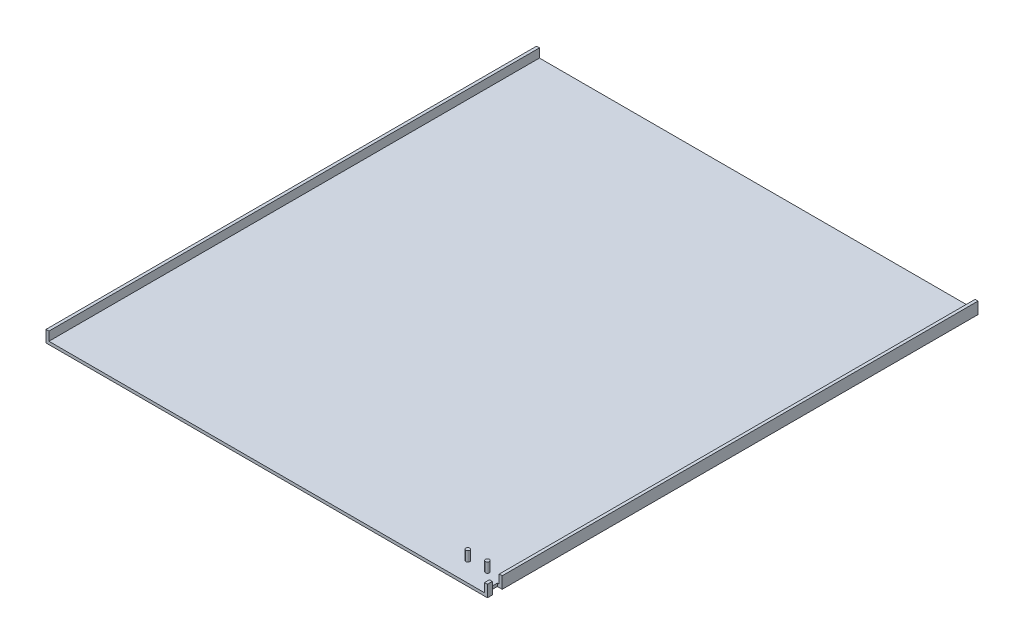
ISO-10303-21;
HEADER;
FILE_DESCRIPTION(('STEP AP214'),'2;1');
FILE_NAME('part.step','',(''),(''),'','','');
FILE_SCHEMA(('AUTOMOTIVE_DESIGN { 1 0 10303 214 1 1 1 1 }'));
ENDSEC;
DATA;
#1=APPLICATION_CONTEXT('core data for automotive mechanical design processes');
#2=APPLICATION_PROTOCOL_DEFINITION('international standard','automotive_design',2000,#1);
#3=PRODUCT_CONTEXT('',#1,'mechanical');
#4=PRODUCT('Part','Part','',(#3));
#5=PRODUCT_RELATED_PRODUCT_CATEGORY('part','',(#4));
#6=PRODUCT_DEFINITION_FORMATION('','',#4);
#7=PRODUCT_DEFINITION_CONTEXT('part definition',#1,'design');
#8=PRODUCT_DEFINITION('design','',#6,#7);
#9=PRODUCT_DEFINITION_SHAPE('','',#8);
#10=(LENGTH_UNIT() NAMED_UNIT(*) SI_UNIT(.MILLI.,.METRE.));
#11=(NAMED_UNIT(*) PLANE_ANGLE_UNIT() SI_UNIT($,.RADIAN.));
#12=(NAMED_UNIT(*) SI_UNIT($,.STERADIAN.) SOLID_ANGLE_UNIT());
#13=UNCERTAINTY_MEASURE_WITH_UNIT(LENGTH_MEASURE(1.E-05),#10,'distance_accuracy_value','');
#14=(GEOMETRIC_REPRESENTATION_CONTEXT(3) GLOBAL_UNCERTAINTY_ASSIGNED_CONTEXT((#13)) GLOBAL_UNIT_ASSIGNED_CONTEXT((#10,
#11,#12)) REPRESENTATION_CONTEXT('',''));
#15=CARTESIAN_POINT('',(0.,0.,0.));
#16=DIRECTION('',(0.,0.,1.));
#17=DIRECTION('',(1.,0.,0.));
#18=AXIS2_PLACEMENT_3D('',#15,#16,#17);
#19=CARTESIAN_POINT('',(450.,0.,500.));
#20=DIRECTION('',(-1.,0.,0.));
#21=DIRECTION('',(0.,0.,1.));
#22=AXIS2_PLACEMENT_3D('',#19,#20,#21);
#23=PLANE('',#22);
#24=DIRECTION('',(0.,0.,-1.));
#25=VECTOR('',#24,1.);
#26=CARTESIAN_POINT('',(450.,0.,500.));
#27=LINE('',#26,#25);
#28=CARTESIAN_POINT('',(450.,0.,500.));
#29=VERTEX_POINT('',#28);
#30=CARTESIAN_POINT('',(450.,0.,495.));
#31=VERTEX_POINT('',#30);
#32=EDGE_CURVE('E164',#29,#31,#27,.T.);
#33=ORIENTED_EDGE('',*,*,#32,.T.);
#34=DIRECTION('',(0.,-1.,0.));
#35=VECTOR('',#34,1.);
#36=CARTESIAN_POINT('',(450.,0.,495.));
#37=LINE('',#36,#35);
#38=CARTESIAN_POINT('',(450.,12.,495.));
#39=VERTEX_POINT('',#38);
#40=EDGE_CURVE('E287',#39,#31,#37,.T.);
#41=ORIENTED_EDGE('',*,*,#40,.F.);
#42=DIRECTION('',(0.,0.,-1.));
#43=VECTOR('',#42,1.);
#44=CARTESIAN_POINT('',(450.,12.,500.));
#45=LINE('',#44,#43);
#46=CARTESIAN_POINT('',(450.,12.,500.));
#47=VERTEX_POINT('',#46);
#48=EDGE_CURVE('E11',#47,#39,#45,.T.);
#49=ORIENTED_EDGE('',*,*,#48,.F.);
#50=DIRECTION('',(0.,1.,0.));
#51=VECTOR('',#50,1.);
#52=CARTESIAN_POINT('',(450.,0.,500.));
#53=LINE('',#52,#51);
#54=EDGE_CURVE('E97',#29,#47,#53,.T.);
#55=ORIENTED_EDGE('',*,*,#54,.F.);
#56=EDGE_LOOP('',(#33,#41,#49,#55));
#57=FACE_BOUND('',#56,.T.);
#58=ADVANCED_FACE('F33',(#57),#23,.F.);
#59=CARTESIAN_POINT('',(447.,12.,500.));
#60=DIRECTION('',(0.,1.,0.));
#61=DIRECTION('',(0.,0.,1.));
#62=AXIS2_PLACEMENT_3D('',#59,#60,#61);
#63=PLANE('',#62);
#64=DIRECTION('',(1.,0.,0.));
#65=VECTOR('',#64,1.);
#66=CARTESIAN_POINT('',(445.,12.,495.));
#67=LINE('',#66,#65);
#68=CARTESIAN_POINT('',(447.,12.,495.));
#69=VERTEX_POINT('',#68);
#70=EDGE_CURVE('E251',#69,#39,#67,.T.);
#71=ORIENTED_EDGE('',*,*,#70,.F.);
#72=DIRECTION('',(0.,0.,-1.));
#73=VECTOR('',#72,1.);
#74=CARTESIAN_POINT('',(447.,12.,500.));
#75=LINE('',#74,#73);
#76=CARTESIAN_POINT('',(447.,12.,500.));
#77=VERTEX_POINT('',#76);
#78=EDGE_CURVE('E175',#77,#69,#75,.T.);
#79=ORIENTED_EDGE('',*,*,#78,.F.);
#80=DIRECTION('',(1.,0.,0.));
#81=VECTOR('',#80,1.);
#82=CARTESIAN_POINT('',(447.,12.,500.));
#83=LINE('',#82,#81);
#84=EDGE_CURVE('E277',#77,#47,#83,.T.);
#85=ORIENTED_EDGE('',*,*,#84,.T.);
#86=ORIENTED_EDGE('',*,*,#48,.T.);
#87=EDGE_LOOP('',(#71,#79,#85,#86));
#88=FACE_BOUND('',#87,.T.);
#89=ADVANCED_FACE('F290',(#88),#63,.T.);
#90=CARTESIAN_POINT('',(447.,0.,500.));
#91=DIRECTION('',(-1.,0.,0.));
#92=DIRECTION('',(0.,0.,1.));
#93=AXIS2_PLACEMENT_3D('',#90,#91,#92);
#94=PLANE('',#93);
#95=DIRECTION('',(0.,1.,0.));
#96=VECTOR('',#95,1.);
#97=CARTESIAN_POINT('',(447.,0.,495.));
#98=LINE('',#97,#96);
#99=CARTESIAN_POINT('',(447.,3.,495.));
#100=VERTEX_POINT('',#99);
#101=EDGE_CURVE('E260',#100,#69,#98,.T.);
#102=ORIENTED_EDGE('',*,*,#101,.F.);
#103=DIRECTION('',(0.,0.,-1.));
#104=VECTOR('',#103,1.);
#105=CARTESIAN_POINT('',(447.,3.,500.));
#106=LINE('',#105,#104);
#107=CARTESIAN_POINT('',(447.,3.,500.));
#108=VERTEX_POINT('',#107);
#109=EDGE_CURVE('E172',#108,#100,#106,.T.);
#110=ORIENTED_EDGE('',*,*,#109,.F.);
#111=DIRECTION('',(0.,1.,0.));
#112=VECTOR('',#111,1.);
#113=CARTESIAN_POINT('',(447.,0.,500.));
#114=LINE('',#113,#112);
#115=EDGE_CURVE('E280',#108,#77,#114,.T.);
#116=ORIENTED_EDGE('',*,*,#115,.T.);
#117=ORIENTED_EDGE('',*,*,#78,.T.);
#118=EDGE_LOOP('',(#102,#110,#116,#117));
#119=FACE_BOUND('',#118,.T.);
#120=ADVANCED_FACE('F291',(#119),#94,.T.);
#121=CARTESIAN_POINT('',(0.,3.,500.));
#122=DIRECTION('',(0.,1.,0.));
#123=DIRECTION('',(0.,0.,1.));
#124=AXIS2_PLACEMENT_3D('',#121,#122,#123);
#125=PLANE('',#124);
#126=DIRECTION('',(1.,0.,0.));
#127=VECTOR('',#126,1.);
#128=CARTESIAN_POINT('',(0.,3.,495.));
#129=LINE('',#128,#127);
#130=CARTESIAN_POINT('',(445.,3.,495.));
#131=VERTEX_POINT('',#130);
#132=EDGE_CURVE('E262',#131,#100,#129,.T.);
#133=ORIENTED_EDGE('',*,*,#132,.F.);
#134=DIRECTION('',(0.,0.,1.));
#135=VECTOR('',#134,1.);
#136=CARTESIAN_POINT('',(445.,3.,500.));
#137=LINE('',#136,#135);
#138=CARTESIAN_POINT('',(445.,3.,485.));
#139=VERTEX_POINT('',#138);
#140=EDGE_CURVE('E256',#139,#131,#137,.T.);
#141=ORIENTED_EDGE('',*,*,#140,.F.);
#142=DIRECTION('',(-1.,0.,0.));
#143=VECTOR('',#142,1.);
#144=CARTESIAN_POINT('',(0.,3.,485.));
#145=LINE('',#144,#143);
#146=CARTESIAN_POINT('',(447.,3.,485.));
#147=VERTEX_POINT('',#146);
#148=EDGE_CURVE('E209',#147,#139,#145,.T.);
#149=ORIENTED_EDGE('',*,*,#148,.F.);
#150=CARTESIAN_POINT('',(447.,3.,0.));
#151=VERTEX_POINT('',#150);
#152=EDGE_CURVE('E171',#147,#151,#106,.T.);
#153=ORIENTED_EDGE('',*,*,#152,.T.);
#154=DIRECTION('',(1.,0.,0.));
#155=VECTOR('',#154,1.);
#156=CARTESIAN_POINT('',(0.,3.,0.));
#157=LINE('',#156,#155);
#158=CARTESIAN_POINT('',(3.,3.,0.));
#159=VERTEX_POINT('',#158);
#160=EDGE_CURVE('E153',#159,#151,#157,.T.);
#161=ORIENTED_EDGE('',*,*,#160,.F.);
#162=DIRECTION('',(0.,0.,-1.));
#163=VECTOR('',#162,1.);
#164=CARTESIAN_POINT('',(3.,3.,500.));
#165=LINE('',#164,#163);
#166=CARTESIAN_POINT('',(3.,3.,500.));
#167=VERTEX_POINT('',#166);
#168=EDGE_CURVE('E169',#167,#159,#165,.T.);
#169=ORIENTED_EDGE('',*,*,#168,.F.);
#170=DIRECTION('',(1.,0.,0.));
#171=VECTOR('',#170,1.);
#172=CARTESIAN_POINT('',(0.,3.,500.));
#173=LINE('',#172,#171);
#174=EDGE_CURVE('E139',#167,#108,#173,.T.);
#175=ORIENTED_EDGE('',*,*,#174,.T.);
#176=ORIENTED_EDGE('',*,*,#109,.T.);
#177=EDGE_LOOP('',(#133,#141,#149,#153,#161,#169,#175,#176));
#178=FACE_BOUND('',#177,.T.);
#179=CARTESIAN_POINT('',(430.,3.,480.));
#180=DIRECTION('',(0.,1.,0.));
#181=DIRECTION('',(0.,0.,1.));
#182=AXIS2_PLACEMENT_3D('',#179,#180,#181);
#183=CIRCLE('',#182,2.);
#184=CARTESIAN_POINT('',(430.,3.,482.));
#185=VERTEX_POINT('',#184);
#186=EDGE_CURVE('E269',#185,#185,#183,.T.);
#187=ORIENTED_EDGE('',*,*,#186,.F.);
#188=EDGE_LOOP('',(#187));
#189=FACE_BOUND('',#188,.T.);
#190=CARTESIAN_POINT('',(410.,3.,480.));
#191=DIRECTION('',(0.,1.,0.));
#192=DIRECTION('',(0.,0.,1.));
#193=AXIS2_PLACEMENT_3D('',#190,#191,#192);
#194=CIRCLE('',#193,2.);
#195=CARTESIAN_POINT('',(410.,3.,482.));
#196=VERTEX_POINT('',#195);
#197=EDGE_CURVE('E265',#196,#196,#194,.T.);
#198=ORIENTED_EDGE('',*,*,#197,.F.);
#199=EDGE_LOOP('',(#198));
#200=FACE_BOUND('',#199,.T.);
#201=ADVANCED_FACE('F202',(#178,#189,#200),#125,.T.);
#202=CARTESIAN_POINT('',(450.,12.,485.));
#203=VERTEX_POINT('',#202);
#204=CARTESIAN_POINT('',(450.,12.,0.));
#205=VERTEX_POINT('',#204);
#206=EDGE_CURVE('E41',#203,#205,#45,.T.);
#207=ORIENTED_EDGE('',*,*,#206,.F.);
#208=DIRECTION('',(0.,1.,0.));
#209=VECTOR('',#208,1.);
#210=CARTESIAN_POINT('',(450.,0.,485.));
#211=LINE('',#210,#209);
#212=CARTESIAN_POINT('',(450.,0.,485.));
#213=VERTEX_POINT('',#212);
#214=EDGE_CURVE('E294',#213,#203,#211,.T.);
#215=ORIENTED_EDGE('',*,*,#214,.F.);
#216=CARTESIAN_POINT('',(450.,0.,0.));
#217=VERTEX_POINT('',#216);
#218=EDGE_CURVE('E91',#213,#217,#27,.T.);
#219=ORIENTED_EDGE('',*,*,#218,.T.);
#220=DIRECTION('',(0.,1.,0.));
#221=VECTOR('',#220,1.);
#222=CARTESIAN_POINT('',(450.,0.,0.));
#223=LINE('',#222,#221);
#224=EDGE_CURVE('E144',#217,#205,#223,.T.);
#225=ORIENTED_EDGE('',*,*,#224,.T.);
#226=EDGE_LOOP('',(#207,#215,#219,#225));
#227=FACE_BOUND('',#226,.T.);
#228=ADVANCED_FACE('F35',(#227),#23,.F.);
#229=DIRECTION('',(1.,0.,0.));
#230=VECTOR('',#229,1.);
#231=CARTESIAN_POINT('',(445.,12.,485.));
#232=LINE('',#231,#230);
#233=CARTESIAN_POINT('',(447.,12.,485.));
#234=VERTEX_POINT('',#233);
#235=EDGE_CURVE('E249',#234,#203,#232,.T.);
#236=ORIENTED_EDGE('',*,*,#235,.T.);
#237=ORIENTED_EDGE('',*,*,#206,.T.);
#238=DIRECTION('',(1.,0.,0.));
#239=VECTOR('',#238,1.);
#240=CARTESIAN_POINT('',(447.,12.,0.));
#241=LINE('',#240,#239);
#242=CARTESIAN_POINT('',(447.,12.,0.));
#243=VERTEX_POINT('',#242);
#244=EDGE_CURVE('E146',#243,#205,#241,.T.);
#245=ORIENTED_EDGE('',*,*,#244,.F.);
#246=EDGE_CURVE('E174',#234,#243,#75,.T.);
#247=ORIENTED_EDGE('',*,*,#246,.F.);
#248=EDGE_LOOP('',(#236,#237,#245,#247));
#249=FACE_BOUND('',#248,.T.);
#250=ADVANCED_FACE('F193',(#249),#63,.T.);
#251=DIRECTION('',(0.,-1.,0.));
#252=VECTOR('',#251,1.);
#253=CARTESIAN_POINT('',(447.,0.,485.));
#254=LINE('',#253,#252);
#255=EDGE_CURVE('E190',#234,#147,#254,.T.);
#256=ORIENTED_EDGE('',*,*,#255,.F.);
#257=ORIENTED_EDGE('',*,*,#246,.T.);
#258=DIRECTION('',(0.,1.,0.));
#259=VECTOR('',#258,1.);
#260=CARTESIAN_POINT('',(447.,0.,0.));
#261=LINE('',#260,#259);
#262=EDGE_CURVE('E150',#151,#243,#261,.T.);
#263=ORIENTED_EDGE('',*,*,#262,.F.);
#264=ORIENTED_EDGE('',*,*,#152,.F.);
#265=EDGE_LOOP('',(#256,#257,#263,#264));
#266=FACE_BOUND('',#265,.T.);
#267=ADVANCED_FACE('F186',(#266),#94,.T.);
#268=CARTESIAN_POINT('',(3.,12.,500.));
#269=DIRECTION('',(1.,0.,0.));
#270=DIRECTION('',(0.,1.,0.));
#271=AXIS2_PLACEMENT_3D('',#268,#269,#270);
#272=PLANE('',#271);
#273=DIRECTION('',(0.,-1.,0.));
#274=VECTOR('',#273,1.);
#275=CARTESIAN_POINT('',(3.,12.,0.));
#276=LINE('',#275,#274);
#277=CARTESIAN_POINT('',(3.,12.,0.));
#278=VERTEX_POINT('',#277);
#279=EDGE_CURVE('E156',#278,#159,#276,.T.);
#280=ORIENTED_EDGE('',*,*,#279,.F.);
#281=DIRECTION('',(0.,0.,-1.));
#282=VECTOR('',#281,1.);
#283=CARTESIAN_POINT('',(3.,12.,500.));
#284=LINE('',#283,#282);
#285=CARTESIAN_POINT('',(3.,12.,500.));
#286=VERTEX_POINT('',#285);
#287=EDGE_CURVE('E125',#286,#278,#284,.T.);
#288=ORIENTED_EDGE('',*,*,#287,.F.);
#289=DIRECTION('',(0.,-1.,0.));
#290=VECTOR('',#289,1.);
#291=CARTESIAN_POINT('',(3.,12.,500.));
#292=LINE('',#291,#290);
#293=EDGE_CURVE('E137',#286,#167,#292,.T.);
#294=ORIENTED_EDGE('',*,*,#293,.T.);
#295=ORIENTED_EDGE('',*,*,#168,.T.);
#296=EDGE_LOOP('',(#280,#288,#294,#295));
#297=FACE_BOUND('',#296,.T.);
#298=ADVANCED_FACE('F283',(#297),#272,.T.);
#299=CARTESIAN_POINT('',(0.,12.,500.));
#300=DIRECTION('',(0.,1.,0.));
#301=DIRECTION('',(0.,0.,1.));
#302=AXIS2_PLACEMENT_3D('',#299,#300,#301);
#303=PLANE('',#302);
#304=DIRECTION('',(1.,0.,0.));
#305=VECTOR('',#304,1.);
#306=CARTESIAN_POINT('',(0.,12.,0.));
#307=LINE('',#306,#305);
#308=CARTESIAN_POINT('',(0.,12.,0.));
#309=VERTEX_POINT('',#308);
#310=EDGE_CURVE('E122',#309,#278,#307,.T.);
#311=ORIENTED_EDGE('',*,*,#310,.F.);
#312=DIRECTION('',(0.,0.,-1.));
#313=VECTOR('',#312,1.);
#314=CARTESIAN_POINT('',(0.,12.,500.));
#315=LINE('',#314,#313);
#316=CARTESIAN_POINT('',(0.,12.,500.));
#317=VERTEX_POINT('',#316);
#318=EDGE_CURVE('E116',#317,#309,#315,.T.);
#319=ORIENTED_EDGE('',*,*,#318,.F.);
#320=DIRECTION('',(1.,0.,0.));
#321=VECTOR('',#320,1.);
#322=CARTESIAN_POINT('',(0.,12.,500.));
#323=LINE('',#322,#321);
#324=EDGE_CURVE('E120',#317,#286,#323,.T.);
#325=ORIENTED_EDGE('',*,*,#324,.T.);
#326=ORIENTED_EDGE('',*,*,#287,.T.);
#327=EDGE_LOOP('',(#311,#319,#325,#326));
#328=FACE_BOUND('',#327,.T.);
#329=ADVANCED_FACE('F118',(#328),#303,.T.);
#330=CARTESIAN_POINT('',(0.,12.,500.));
#331=DIRECTION('',(1.,0.,0.));
#332=DIRECTION('',(0.,1.,0.));
#333=AXIS2_PLACEMENT_3D('',#330,#331,#332);
#334=PLANE('',#333);
#335=DIRECTION('',(0.,-1.,0.));
#336=VECTOR('',#335,1.);
#337=CARTESIAN_POINT('',(0.,12.,0.));
#338=LINE('',#337,#336);
#339=CARTESIAN_POINT('',(0.,0.,0.));
#340=VERTEX_POINT('',#339);
#341=EDGE_CURVE('E160',#309,#340,#338,.T.);
#342=ORIENTED_EDGE('',*,*,#341,.T.);
#343=DIRECTION('',(0.,0.,-1.));
#344=VECTOR('',#343,1.);
#345=CARTESIAN_POINT('',(0.,0.,500.));
#346=LINE('',#345,#344);
#347=CARTESIAN_POINT('',(0.,0.,500.));
#348=VERTEX_POINT('',#347);
#349=EDGE_CURVE('E126',#348,#340,#346,.T.);
#350=ORIENTED_EDGE('',*,*,#349,.F.);
#351=DIRECTION('',(0.,-1.,0.));
#352=VECTOR('',#351,1.);
#353=CARTESIAN_POINT('',(0.,12.,500.));
#354=LINE('',#353,#352);
#355=EDGE_CURVE('E129',#317,#348,#354,.T.);
#356=ORIENTED_EDGE('',*,*,#355,.F.);
#357=ORIENTED_EDGE('',*,*,#318,.T.);
#358=EDGE_LOOP('',(#342,#350,#356,#357));
#359=FACE_BOUND('',#358,.T.);
#360=ADVANCED_FACE('F130',(#359),#334,.F.);
#361=CARTESIAN_POINT('',(0.,0.,500.));
#362=DIRECTION('',(0.,1.,0.));
#363=DIRECTION('',(0.,0.,1.));
#364=AXIS2_PLACEMENT_3D('',#361,#362,#363);
#365=PLANE('',#364);
#366=DIRECTION('',(0.,0.,-1.));
#367=VECTOR('',#366,1.);
#368=CARTESIAN_POINT('',(445.,0.,495.));
#369=LINE('',#368,#367);
#370=CARTESIAN_POINT('',(445.,0.,495.));
#371=VERTEX_POINT('',#370);
#372=CARTESIAN_POINT('',(445.,0.,485.));
#373=VERTEX_POINT('',#372);
#374=EDGE_CURVE('E241',#371,#373,#369,.T.);
#375=ORIENTED_EDGE('',*,*,#374,.F.);
#376=DIRECTION('',(1.,0.,0.));
#377=VECTOR('',#376,1.);
#378=CARTESIAN_POINT('',(445.,0.,495.));
#379=LINE('',#378,#377);
#380=EDGE_CURVE('E48',#371,#31,#379,.T.);
#381=ORIENTED_EDGE('',*,*,#380,.T.);
#382=ORIENTED_EDGE('',*,*,#32,.F.);
#383=DIRECTION('',(1.,0.,0.));
#384=VECTOR('',#383,1.);
#385=CARTESIAN_POINT('',(0.,0.,500.));
#386=LINE('',#385,#384);
#387=EDGE_CURVE('E57',#348,#29,#386,.T.);
#388=ORIENTED_EDGE('',*,*,#387,.F.);
#389=ORIENTED_EDGE('',*,*,#349,.T.);
#390=DIRECTION('',(1.,0.,0.));
#391=VECTOR('',#390,1.);
#392=CARTESIAN_POINT('',(0.,0.,0.));
#393=LINE('',#392,#391);
#394=EDGE_CURVE('E162',#340,#217,#393,.T.);
#395=ORIENTED_EDGE('',*,*,#394,.T.);
#396=ORIENTED_EDGE('',*,*,#218,.F.);
#397=DIRECTION('',(1.,0.,0.));
#398=VECTOR('',#397,1.);
#399=CARTESIAN_POINT('',(445.,0.,485.));
#400=LINE('',#399,#398);
#401=EDGE_CURVE('E239',#373,#213,#400,.T.);
#402=ORIENTED_EDGE('',*,*,#401,.F.);
#403=EDGE_LOOP('',(#375,#381,#382,#388,#389,#395,#396,#402));
#404=FACE_BOUND('',#403,.T.);
#405=ADVANCED_FACE('F248',(#404),#365,.F.);
#406=CARTESIAN_POINT('',(450.,12.,500.));
#407=DIRECTION('',(0.,0.,-1.));
#408=DIRECTION('',(-1.,0.,0.));
#409=AXIS2_PLACEMENT_3D('',#406,#407,#408);
#410=PLANE('',#409);
#411=ORIENTED_EDGE('',*,*,#54,.T.);
#412=ORIENTED_EDGE('',*,*,#84,.F.);
#413=ORIENTED_EDGE('',*,*,#115,.F.);
#414=ORIENTED_EDGE('',*,*,#174,.F.);
#415=ORIENTED_EDGE('',*,*,#293,.F.);
#416=ORIENTED_EDGE('',*,*,#324,.F.);
#417=ORIENTED_EDGE('',*,*,#355,.T.);
#418=ORIENTED_EDGE('',*,*,#387,.T.);
#419=EDGE_LOOP('',(#411,#412,#413,#414,#415,#416,#417,#418));
#420=FACE_BOUND('',#419,.T.);
#421=ADVANCED_FACE('F134',(#420),#410,.F.);
#422=CARTESIAN_POINT('',(450.,12.,0.));
#423=DIRECTION('',(0.,0.,-1.));
#424=DIRECTION('',(-1.,0.,0.));
#425=AXIS2_PLACEMENT_3D('',#422,#423,#424);
#426=PLANE('',#425);
#427=ORIENTED_EDGE('',*,*,#224,.F.);
#428=ORIENTED_EDGE('',*,*,#394,.F.);
#429=ORIENTED_EDGE('',*,*,#341,.F.);
#430=ORIENTED_EDGE('',*,*,#310,.T.);
#431=ORIENTED_EDGE('',*,*,#279,.T.);
#432=ORIENTED_EDGE('',*,*,#160,.T.);
#433=ORIENTED_EDGE('',*,*,#262,.T.);
#434=ORIENTED_EDGE('',*,*,#244,.T.);
#435=EDGE_LOOP('',(#427,#428,#429,#430,#431,#432,#433,#434));
#436=FACE_BOUND('',#435,.T.);
#437=ADVANCED_FACE('F197',(#436),#426,.T.);
#438=CARTESIAN_POINT('',(430.,13.,480.));
#439=DIRECTION('',(0.,-1.,0.));
#440=DIRECTION('',(0.,0.,-1.));
#441=AXIS2_PLACEMENT_3D('',#438,#439,#440);
#442=CYLINDRICAL_SURFACE('',#441,2.);
#443=CARTESIAN_POINT('',(430.,13.,480.));
#444=DIRECTION('',(0.,1.,0.));
#445=DIRECTION('',(0.,0.,1.));
#446=AXIS2_PLACEMENT_3D('',#443,#444,#445);
#447=CIRCLE('',#446,2.);
#448=CARTESIAN_POINT('',(430.,13.,482.));
#449=VERTEX_POINT('',#448);
#450=EDGE_CURVE('E147',#449,#449,#447,.T.);
#451=ORIENTED_EDGE('',*,*,#450,.F.);
#452=EDGE_LOOP('',(#451));
#453=FACE_BOUND('',#452,.T.);
#454=ORIENTED_EDGE('',*,*,#186,.T.);
#455=EDGE_LOOP('',(#454));
#456=FACE_BOUND('',#455,.T.);
#457=ADVANCED_FACE('F324',(#453,#456),#442,.T.);
#458=CARTESIAN_POINT('',(430.,13.,480.));
#459=DIRECTION('',(0.,1.,0.));
#460=DIRECTION('',(0.,0.,1.));
#461=AXIS2_PLACEMENT_3D('',#458,#459,#460);
#462=PLANE('',#461);
#463=ORIENTED_EDGE('',*,*,#450,.T.);
#464=EDGE_LOOP('',(#463));
#465=FACE_BOUND('',#464,.T.);
#466=ADVANCED_FACE('F329',(#465),#462,.T.);
#467=CARTESIAN_POINT('',(410.,13.,480.));
#468=DIRECTION('',(0.,-1.,0.));
#469=DIRECTION('',(0.,0.,-1.));
#470=AXIS2_PLACEMENT_3D('',#467,#468,#469);
#471=CYLINDRICAL_SURFACE('',#470,2.);
#472=CARTESIAN_POINT('',(410.,13.,480.));
#473=DIRECTION('',(0.,1.,0.));
#474=DIRECTION('',(0.,0.,1.));
#475=AXIS2_PLACEMENT_3D('',#472,#473,#474);
#476=CIRCLE('',#475,2.);
#477=CARTESIAN_POINT('',(410.,13.,482.));
#478=VERTEX_POINT('',#477);
#479=EDGE_CURVE('E266',#478,#478,#476,.T.);
#480=ORIENTED_EDGE('',*,*,#479,.F.);
#481=EDGE_LOOP('',(#480));
#482=FACE_BOUND('',#481,.T.);
#483=ORIENTED_EDGE('',*,*,#197,.T.);
#484=EDGE_LOOP('',(#483));
#485=FACE_BOUND('',#484,.T.);
#486=ADVANCED_FACE('F333',(#482,#485),#471,.T.);
#487=CARTESIAN_POINT('',(410.,13.,480.));
#488=DIRECTION('',(0.,1.,0.));
#489=DIRECTION('',(0.,0.,1.));
#490=AXIS2_PLACEMENT_3D('',#487,#488,#489);
#491=PLANE('',#490);
#492=ORIENTED_EDGE('',*,*,#479,.T.);
#493=EDGE_LOOP('',(#492));
#494=FACE_BOUND('',#493,.T.);
#495=ADVANCED_FACE('F337',(#494),#491,.T.);
#496=CARTESIAN_POINT('',(445.,0.,495.));
#497=DIRECTION('',(0.,0.,1.));
#498=DIRECTION('',(1.,0.,0.));
#499=AXIS2_PLACEMENT_3D('',#496,#497,#498);
#500=PLANE('',#499);
#501=ORIENTED_EDGE('',*,*,#132,.T.);
#502=ORIENTED_EDGE('',*,*,#101,.T.);
#503=ORIENTED_EDGE('',*,*,#70,.T.);
#504=ORIENTED_EDGE('',*,*,#40,.T.);
#505=ORIENTED_EDGE('',*,*,#380,.F.);
#506=DIRECTION('',(0.,-1.,0.));
#507=VECTOR('',#506,1.);
#508=CARTESIAN_POINT('',(445.,0.,495.));
#509=LINE('',#508,#507);
#510=EDGE_CURVE('E245',#131,#371,#509,.T.);
#511=ORIENTED_EDGE('',*,*,#510,.F.);
#512=EDGE_LOOP('',(#501,#502,#503,#504,#505,#511));
#513=FACE_BOUND('',#512,.T.);
#514=ADVANCED_FACE('F292',(#513),#500,.F.);
#515=CARTESIAN_POINT('',(445.,0.,485.));
#516=DIRECTION('',(0.,0.,-1.));
#517=DIRECTION('',(-1.,0.,0.));
#518=AXIS2_PLACEMENT_3D('',#515,#516,#517);
#519=PLANE('',#518);
#520=ORIENTED_EDGE('',*,*,#148,.T.);
#521=DIRECTION('',(0.,1.,0.));
#522=VECTOR('',#521,1.);
#523=CARTESIAN_POINT('',(445.,0.,485.));
#524=LINE('',#523,#522);
#525=EDGE_CURVE('E235',#373,#139,#524,.T.);
#526=ORIENTED_EDGE('',*,*,#525,.F.);
#527=ORIENTED_EDGE('',*,*,#401,.T.);
#528=ORIENTED_EDGE('',*,*,#214,.T.);
#529=ORIENTED_EDGE('',*,*,#235,.F.);
#530=ORIENTED_EDGE('',*,*,#255,.T.);
#531=EDGE_LOOP('',(#520,#526,#527,#528,#529,#530));
#532=FACE_BOUND('',#531,.T.);
#533=ADVANCED_FACE('F237',(#532),#519,.F.);
#534=CARTESIAN_POINT('',(445.,12.,495.));
#535=DIRECTION('',(-1.,0.,0.));
#536=DIRECTION('',(0.,0.,1.));
#537=AXIS2_PLACEMENT_3D('',#534,#535,#536);
#538=PLANE('',#537);
#539=ORIENTED_EDGE('',*,*,#140,.T.);
#540=ORIENTED_EDGE('',*,*,#510,.T.);
#541=ORIENTED_EDGE('',*,*,#374,.T.);
#542=ORIENTED_EDGE('',*,*,#525,.T.);
#543=EDGE_LOOP('',(#539,#540,#541,#542));
#544=FACE_BOUND('',#543,.T.);
#545=ADVANCED_FACE('F244',(#544),#538,.F.);
#546=CLOSED_SHELL('',(#58,#89,#120,#201,#228,#250,#267,#298,#329,#360,#405,#421,#437,#457,#466,
#486,#495,#514,#533,#545));
#547=MANIFOLD_SOLID_BREP('B2',#546);
#548=ADVANCED_BREP_SHAPE_REPRESENTATION('',(#18,#547),#14);
#549=SHAPE_DEFINITION_REPRESENTATION(#9,#548);
ENDSEC;
END-ISO-10303-21;
